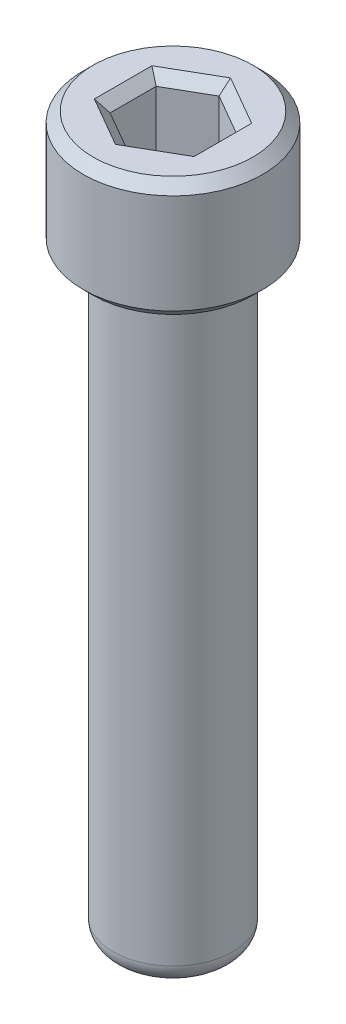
from build123d import *

# Parameters (mm, degrees)
SKETCH1_R           = 1.5
BOSS_EXTRUDE1_DEPTH = 15
SKETCH2_R           = 2.25
BOSS_EXTRUDE2_DEPTH = 3
CUT_EXTRUDE1_DEPTH  = 2
CHAMFER1_SIZE       = 0.25
FILLET1_R           = 0.5


with BuildPart() as part:
    # Sketch1 → Boss-Extrude1 (new body)
    with BuildSketch(Plane(origin=(0, 0, 0), x_dir=(1, 0, 0), z_dir=(0, 1, 0))):
        with Locations(Location((0, 0, 0), (0, 0, 270))):
            Circle(SKETCH1_R)
    extrude(amount=BOSS_EXTRUDE1_DEPTH)

    # Sketch2 → Boss-Extrude2 (add)
    with BuildSketch(Plane(origin=(0, 15, 0), x_dir=(1, 0, 0), z_dir=(0, 1, 0))):
        with Locations(Location((0, 0, 0), (0, 0, 270))):
            Circle(SKETCH2_R)
    extrude(amount=BOSS_EXTRUDE2_DEPTH)

    # Sketch3 → Cut-Extrude1 (cut)
    with BuildSketch(Plane(origin=(0, 18, 0), x_dir=(1, 0, 0), z_dir=(0, 1, 0))):
        Polygon((0, 1.154700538), (-1, 0.577350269), (-1, -0.577350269), (0, -1.154700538), (1, -0.577350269), (1, 0.577350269), align=None)
    extrude(amount=-CUT_EXTRUDE1_DEPTH, mode=Mode.SUBTRACT)

    # Chamfer1
    chamfer1_edges = [part.edges().sort_by_distance(p)[0] for p in [
        (0.5, 18, -0.866025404),
        (-0.5, 18, -0.866025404),
        (-1, 18, 0),
        (-0.5, 18, 0.866025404),
        (0.5, 18, 0.866025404),
        (1, 18, 0),
        (0, 15, -2.25),
        (0, 18, -2.25),
    ]]
    chamfer(chamfer1_edges, length=CHAMFER1_SIZE)

    # Fillet1
    fillet1_edges = [part.edges().sort_by_distance(p)[0] for p in [
        (0, 0, -1.5),
    ]]
    fillet(fillet1_edges, radius=FILLET1_R)


solid = part.part
